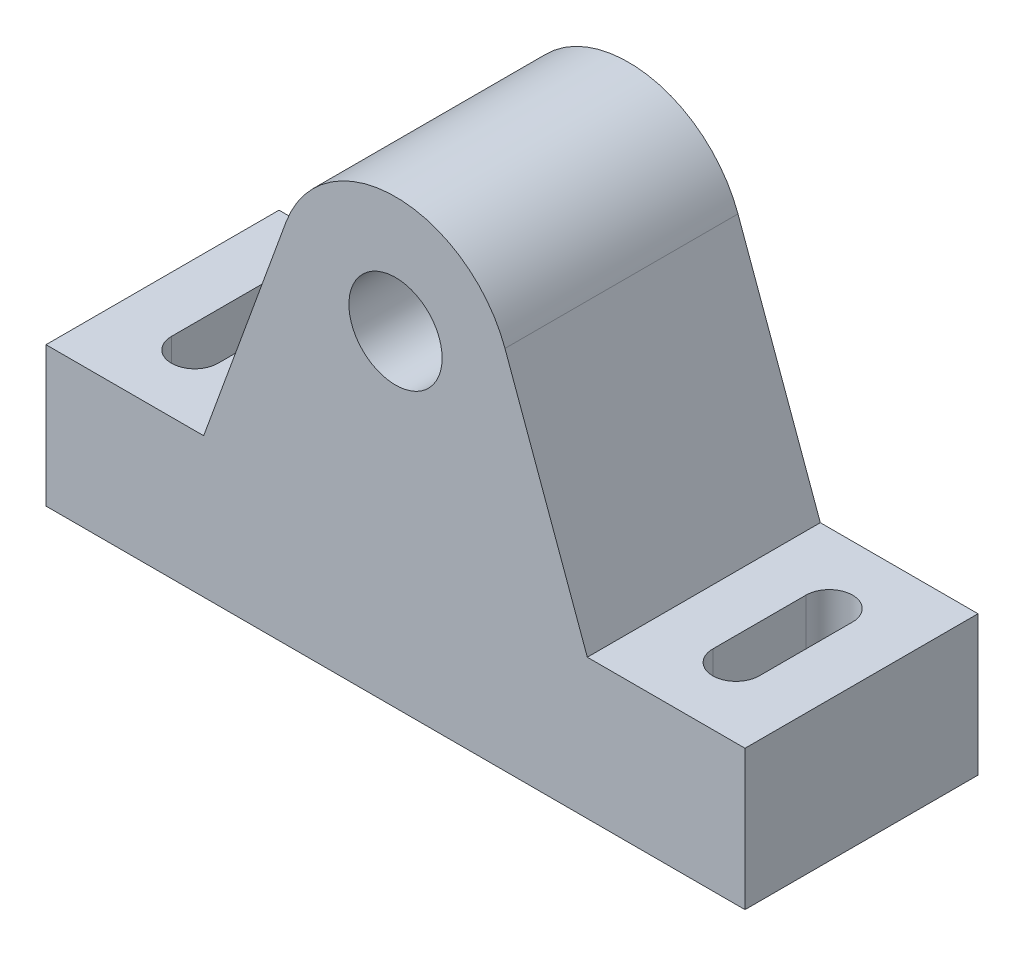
ISO-10303-21;
HEADER;
FILE_DESCRIPTION(('STEP AP214'),'2;1');
FILE_NAME('part.step','',(''),(''),'','','');
FILE_SCHEMA(('AUTOMOTIVE_DESIGN { 1 0 10303 214 1 1 1 1 }'));
ENDSEC;
DATA;
#1=APPLICATION_CONTEXT('core data for automotive mechanical design processes');
#2=APPLICATION_PROTOCOL_DEFINITION('international standard','automotive_design',2000,#1);
#3=PRODUCT_CONTEXT('',#1,'mechanical');
#4=PRODUCT('Part','Part','',(#3));
#5=PRODUCT_RELATED_PRODUCT_CATEGORY('part','',(#4));
#6=PRODUCT_DEFINITION_FORMATION('','',#4);
#7=PRODUCT_DEFINITION_CONTEXT('part definition',#1,'design');
#8=PRODUCT_DEFINITION('design','',#6,#7);
#9=PRODUCT_DEFINITION_SHAPE('','',#8);
#10=(LENGTH_UNIT() NAMED_UNIT(*) SI_UNIT(.MILLI.,.METRE.));
#11=(NAMED_UNIT(*) PLANE_ANGLE_UNIT() SI_UNIT($,.RADIAN.));
#12=(NAMED_UNIT(*) SI_UNIT($,.STERADIAN.) SOLID_ANGLE_UNIT());
#13=UNCERTAINTY_MEASURE_WITH_UNIT(LENGTH_MEASURE(1.E-05),#10,'distance_accuracy_value','');
#14=(GEOMETRIC_REPRESENTATION_CONTEXT(3) GLOBAL_UNCERTAINTY_ASSIGNED_CONTEXT((#13)) GLOBAL_UNIT_ASSIGNED_CONTEXT((#10,
#11,#12)) REPRESENTATION_CONTEXT('',''));
#15=CARTESIAN_POINT('',(0.,0.,0.));
#16=DIRECTION('',(0.,0.,1.));
#17=DIRECTION('',(1.,0.,0.));
#18=AXIS2_PLACEMENT_3D('',#15,#16,#17);
#19=CARTESIAN_POINT('',(0.,70.,25.));
#20=DIRECTION('',(0.,0.,-1.));
#21=DIRECTION('',(-1.,0.,0.));
#22=AXIS2_PLACEMENT_3D('',#19,#20,#21);
#23=PLANE('',#22);
#24=DIRECTION('',(1.,0.,0.));
#25=VECTOR('',#24,1.);
#26=CARTESIAN_POINT('',(-75.,30.,25.));
#27=LINE('',#26,#25);
#28=CARTESIAN_POINT('',(-75.,30.,25.));
#29=VERTEX_POINT('',#28);
#30=CARTESIAN_POINT('',(-41.1632536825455,30.,25.));
#31=VERTEX_POINT('',#30);
#32=EDGE_CURVE('E258',#29,#31,#27,.T.);
#33=ORIENTED_EDGE('',*,*,#32,.F.);
#34=DIRECTION('',(0.,1.,0.));
#35=VECTOR('',#34,1.);
#36=CARTESIAN_POINT('',(-75.,0.,25.));
#37=LINE('',#36,#35);
#38=CARTESIAN_POINT('',(-75.,0.,25.));
#39=VERTEX_POINT('',#38);
#40=EDGE_CURVE('E277',#39,#29,#37,.T.);
#41=ORIENTED_EDGE('',*,*,#40,.F.);
#42=DIRECTION('',(-1.,0.,0.));
#43=VECTOR('',#42,1.);
#44=CARTESIAN_POINT('',(75.,0.,25.));
#45=LINE('',#44,#43);
#46=CARTESIAN_POINT('',(75.,0.,25.));
#47=VERTEX_POINT('',#46);
#48=EDGE_CURVE('E274',#47,#39,#45,.T.);
#49=ORIENTED_EDGE('',*,*,#48,.F.);
#50=DIRECTION('',(0.,1.,0.));
#51=VECTOR('',#50,1.);
#52=CARTESIAN_POINT('',(75.,0.,25.));
#53=LINE('',#52,#51);
#54=CARTESIAN_POINT('',(75.,30.,25.));
#55=VERTEX_POINT('',#54);
#56=EDGE_CURVE('E272',#47,#55,#53,.T.);
#57=ORIENTED_EDGE('',*,*,#56,.T.);
#58=DIRECTION('',(-1.,0.,0.));
#59=VECTOR('',#58,1.);
#60=CARTESIAN_POINT('',(75.,30.,25.));
#61=LINE('',#60,#59);
#62=CARTESIAN_POINT('',(41.1632536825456,30.,25.));
#63=VERTEX_POINT('',#62);
#64=EDGE_CURVE('E270',#55,#63,#61,.T.);
#65=ORIENTED_EDGE('',*,*,#64,.T.);
#66=DIRECTION('',(-0.342020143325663,0.939692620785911,0.));
#67=VECTOR('',#66,1.);
#68=CARTESIAN_POINT('',(41.1632536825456,30.,25.));
#69=LINE('',#68,#67);
#70=CARTESIAN_POINT('',(23.4923155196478,78.5505035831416,25.));
#71=VERTEX_POINT('',#70);
#72=EDGE_CURVE('E268',#63,#71,#69,.T.);
#73=ORIENTED_EDGE('',*,*,#72,.T.);
#74=CARTESIAN_POINT('',(0.,70.,25.));
#75=DIRECTION('',(0.,0.,-1.));
#76=DIRECTION('',(-1.,0.,0.));
#77=AXIS2_PLACEMENT_3D('',#74,#75,#76);
#78=CIRCLE('',#77,25.);
#79=CARTESIAN_POINT('',(-23.4923155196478,78.5505035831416,25.));
#80=VERTEX_POINT('',#79);
#81=EDGE_CURVE('E265',#80,#71,#78,.T.);
#82=ORIENTED_EDGE('',*,*,#81,.F.);
#83=DIRECTION('',(0.342020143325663,0.939692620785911,0.));
#84=VECTOR('',#83,1.);
#85=CARTESIAN_POINT('',(-41.1632536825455,30.,25.));
#86=LINE('',#85,#84);
#87=EDGE_CURVE('E261',#31,#80,#86,.T.);
#88=ORIENTED_EDGE('',*,*,#87,.F.);
#89=EDGE_LOOP('',(#33,#41,#49,#57,#65,#73,#82,#88));
#90=FACE_BOUND('',#89,.T.);
#91=CARTESIAN_POINT('',(0.,70.,25.));
#92=DIRECTION('',(0.,0.,1.));
#93=DIRECTION('',(1.,0.,0.));
#94=AXIS2_PLACEMENT_3D('',#91,#92,#93);
#95=CIRCLE('',#94,10.);
#96=CARTESIAN_POINT('',(10.,70.,25.));
#97=VERTEX_POINT('',#96);
#98=EDGE_CURVE('E251',#97,#97,#95,.T.);
#99=ORIENTED_EDGE('',*,*,#98,.F.);
#100=EDGE_LOOP('',(#99));
#101=FACE_BOUND('',#100,.T.);
#102=ADVANCED_FACE('F68',(#90,#101),#23,.F.);
#103=CARTESIAN_POINT('',(0.,70.,-25.));
#104=DIRECTION('',(0.,0.,-1.));
#105=DIRECTION('',(-1.,0.,0.));
#106=AXIS2_PLACEMENT_3D('',#103,#104,#105);
#107=PLANE('',#106);
#108=DIRECTION('',(1.,0.,0.));
#109=VECTOR('',#108,1.);
#110=CARTESIAN_POINT('',(-75.,30.,-25.));
#111=LINE('',#110,#109);
#112=CARTESIAN_POINT('',(-75.,30.,-25.));
#113=VERTEX_POINT('',#112);
#114=CARTESIAN_POINT('',(-41.1632536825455,30.,-25.));
#115=VERTEX_POINT('',#114);
#116=EDGE_CURVE('E255',#113,#115,#111,.T.);
#117=ORIENTED_EDGE('',*,*,#116,.T.);
#118=DIRECTION('',(0.342020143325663,0.939692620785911,0.));
#119=VECTOR('',#118,1.);
#120=CARTESIAN_POINT('',(-41.1632536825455,30.,-25.));
#121=LINE('',#120,#119);
#122=CARTESIAN_POINT('',(-23.4923155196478,78.5505035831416,-25.));
#123=VERTEX_POINT('',#122);
#124=EDGE_CURVE('E282',#115,#123,#121,.T.);
#125=ORIENTED_EDGE('',*,*,#124,.T.);
#126=CARTESIAN_POINT('',(0.,70.,-25.));
#127=DIRECTION('',(0.,0.,-1.));
#128=DIRECTION('',(-1.,0.,0.));
#129=AXIS2_PLACEMENT_3D('',#126,#127,#128);
#130=CIRCLE('',#129,25.);
#131=CARTESIAN_POINT('',(23.4923155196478,78.5505035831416,-25.));
#132=VERTEX_POINT('',#131);
#133=EDGE_CURVE('E285',#123,#132,#130,.T.);
#134=ORIENTED_EDGE('',*,*,#133,.T.);
#135=DIRECTION('',(-0.342020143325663,0.939692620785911,0.));
#136=VECTOR('',#135,1.);
#137=CARTESIAN_POINT('',(41.1632536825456,30.,-25.));
#138=LINE('',#137,#136);
#139=CARTESIAN_POINT('',(41.1632536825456,30.,-25.));
#140=VERTEX_POINT('',#139);
#141=EDGE_CURVE('E288',#140,#132,#138,.T.);
#142=ORIENTED_EDGE('',*,*,#141,.F.);
#143=DIRECTION('',(-1.,0.,0.));
#144=VECTOR('',#143,1.);
#145=CARTESIAN_POINT('',(75.,30.,-25.));
#146=LINE('',#145,#144);
#147=CARTESIAN_POINT('',(75.,30.,-25.));
#148=VERTEX_POINT('',#147);
#149=EDGE_CURVE('E291',#148,#140,#146,.T.);
#150=ORIENTED_EDGE('',*,*,#149,.F.);
#151=DIRECTION('',(0.,1.,0.));
#152=VECTOR('',#151,1.);
#153=CARTESIAN_POINT('',(75.,0.,-25.));
#154=LINE('',#153,#152);
#155=CARTESIAN_POINT('',(75.,0.,-25.));
#156=VERTEX_POINT('',#155);
#157=EDGE_CURVE('E293',#156,#148,#154,.T.);
#158=ORIENTED_EDGE('',*,*,#157,.F.);
#159=DIRECTION('',(-1.,0.,0.));
#160=VECTOR('',#159,1.);
#161=CARTESIAN_POINT('',(75.,0.,-25.));
#162=LINE('',#161,#160);
#163=CARTESIAN_POINT('',(-75.,0.,-25.));
#164=VERTEX_POINT('',#163);
#165=EDGE_CURVE('E295',#156,#164,#162,.T.);
#166=ORIENTED_EDGE('',*,*,#165,.T.);
#167=DIRECTION('',(0.,1.,0.));
#168=VECTOR('',#167,1.);
#169=CARTESIAN_POINT('',(-75.,0.,-25.));
#170=LINE('',#169,#168);
#171=EDGE_CURVE('E262',#164,#113,#170,.T.);
#172=ORIENTED_EDGE('',*,*,#171,.T.);
#173=EDGE_LOOP('',(#117,#125,#134,#142,#150,#158,#166,#172));
#174=FACE_BOUND('',#173,.T.);
#175=CARTESIAN_POINT('',(0.,70.,-25.));
#176=DIRECTION('',(0.,0.,1.));
#177=DIRECTION('',(1.,0.,0.));
#178=AXIS2_PLACEMENT_3D('',#175,#176,#177);
#179=CIRCLE('',#178,10.);
#180=CARTESIAN_POINT('',(10.,70.,-25.));
#181=VERTEX_POINT('',#180);
#182=EDGE_CURVE('E216',#181,#181,#179,.T.);
#183=ORIENTED_EDGE('',*,*,#182,.T.);
#184=EDGE_LOOP('',(#183));
#185=FACE_BOUND('',#184,.T.);
#186=ADVANCED_FACE('F320',(#174,#185),#107,.T.);
#187=CARTESIAN_POINT('',(-75.,30.,25.));
#188=DIRECTION('',(0.,1.,0.));
#189=DIRECTION('',(-1.,0.,0.));
#190=AXIS2_PLACEMENT_3D('',#187,#188,#189);
#191=PLANE('',#190);
#192=CARTESIAN_POINT('',(-58.0816268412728,30.,10.));
#193=DIRECTION('',(0.,1.,0.));
#194=DIRECTION('',(-1.,0.,0.));
#195=AXIS2_PLACEMENT_3D('',#192,#193,#194);
#196=CIRCLE('',#195,5.);
#197=CARTESIAN_POINT('',(-63.0816268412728,30.,10.));
#198=VERTEX_POINT('',#197);
#199=CARTESIAN_POINT('',(-53.0816268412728,30.,10.));
#200=VERTEX_POINT('',#199);
#201=EDGE_CURVE('E85',#198,#200,#196,.T.);
#202=ORIENTED_EDGE('',*,*,#201,.F.);
#203=DIRECTION('',(0.,0.,1.));
#204=VECTOR('',#203,1.);
#205=CARTESIAN_POINT('',(-63.0816268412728,30.,10.));
#206=LINE('',#205,#204);
#207=CARTESIAN_POINT('',(-63.0816268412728,30.,-10.));
#208=VERTEX_POINT('',#207);
#209=EDGE_CURVE('E200',#208,#198,#206,.T.);
#210=ORIENTED_EDGE('',*,*,#209,.F.);
#211=CARTESIAN_POINT('',(-58.0816268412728,30.,-10.));
#212=DIRECTION('',(0.,1.,0.));
#213=DIRECTION('',(-1.,0.,0.));
#214=AXIS2_PLACEMENT_3D('',#211,#212,#213);
#215=CIRCLE('',#214,5.);
#216=CARTESIAN_POINT('',(-53.0816268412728,30.,-10.));
#217=VERTEX_POINT('',#216);
#218=EDGE_CURVE('E203',#217,#208,#215,.T.);
#219=ORIENTED_EDGE('',*,*,#218,.F.);
#220=DIRECTION('',(0.,0.,-1.));
#221=VECTOR('',#220,1.);
#222=CARTESIAN_POINT('',(-53.0816268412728,30.,10.));
#223=LINE('',#222,#221);
#224=EDGE_CURVE('E209',#200,#217,#223,.T.);
#225=ORIENTED_EDGE('',*,*,#224,.F.);
#226=EDGE_LOOP('',(#202,#210,#219,#225));
#227=FACE_BOUND('',#226,.T.);
#228=ORIENTED_EDGE('',*,*,#116,.F.);
#229=DIRECTION('',(0.,0.,-1.));
#230=VECTOR('',#229,1.);
#231=CARTESIAN_POINT('',(-75.,30.,25.));
#232=LINE('',#231,#230);
#233=EDGE_CURVE('E12',#29,#113,#232,.T.);
#234=ORIENTED_EDGE('',*,*,#233,.F.);
#235=ORIENTED_EDGE('',*,*,#32,.T.);
#236=DIRECTION('',(0.,0.,-1.));
#237=VECTOR('',#236,1.);
#238=CARTESIAN_POINT('',(-41.1632536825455,30.,25.));
#239=LINE('',#238,#237);
#240=EDGE_CURVE('E72',#31,#115,#239,.T.);
#241=ORIENTED_EDGE('',*,*,#240,.T.);
#242=EDGE_LOOP('',(#228,#234,#235,#241));
#243=FACE_BOUND('',#242,.T.);
#244=ADVANCED_FACE('F70',(#227,#243),#191,.T.);
#245=CARTESIAN_POINT('',(-75.,0.,25.));
#246=DIRECTION('',(-1.,0.,0.));
#247=DIRECTION('',(0.,-1.,0.));
#248=AXIS2_PLACEMENT_3D('',#245,#246,#247);
#249=PLANE('',#248);
#250=ORIENTED_EDGE('',*,*,#171,.F.);
#251=DIRECTION('',(0.,0.,-1.));
#252=VECTOR('',#251,1.);
#253=CARTESIAN_POINT('',(-75.,0.,25.));
#254=LINE('',#253,#252);
#255=EDGE_CURVE('E77',#39,#164,#254,.T.);
#256=ORIENTED_EDGE('',*,*,#255,.F.);
#257=ORIENTED_EDGE('',*,*,#40,.T.);
#258=ORIENTED_EDGE('',*,*,#233,.T.);
#259=EDGE_LOOP('',(#250,#256,#257,#258));
#260=FACE_BOUND('',#259,.T.);
#261=ADVANCED_FACE('F326',(#260),#249,.T.);
#262=CARTESIAN_POINT('',(75.,0.,25.));
#263=DIRECTION('',(0.,-1.,0.));
#264=DIRECTION('',(0.,0.,-1.));
#265=AXIS2_PLACEMENT_3D('',#262,#263,#264);
#266=PLANE('',#265);
#267=CARTESIAN_POINT('',(-58.0816268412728,0.,10.));
#268=DIRECTION('',(0.,1.,0.));
#269=DIRECTION('',(-1.,0.,0.));
#270=AXIS2_PLACEMENT_3D('',#267,#268,#269);
#271=CIRCLE('',#270,5.);
#272=CARTESIAN_POINT('',(-63.0816268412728,0.,10.));
#273=VERTEX_POINT('',#272);
#274=CARTESIAN_POINT('',(-53.0816268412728,0.,10.));
#275=VERTEX_POINT('',#274);
#276=EDGE_CURVE('E184',#273,#275,#271,.T.);
#277=ORIENTED_EDGE('',*,*,#276,.T.);
#278=DIRECTION('',(0.,0.,-1.));
#279=VECTOR('',#278,1.);
#280=CARTESIAN_POINT('',(-53.0816268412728,0.,10.));
#281=LINE('',#280,#279);
#282=CARTESIAN_POINT('',(-53.0816268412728,0.,-10.));
#283=VERTEX_POINT('',#282);
#284=EDGE_CURVE('E193',#275,#283,#281,.T.);
#285=ORIENTED_EDGE('',*,*,#284,.T.);
#286=CARTESIAN_POINT('',(-58.0816268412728,0.,-10.));
#287=DIRECTION('',(0.,1.,0.));
#288=DIRECTION('',(-1.,0.,0.));
#289=AXIS2_PLACEMENT_3D('',#286,#287,#288);
#290=CIRCLE('',#289,5.);
#291=CARTESIAN_POINT('',(-63.0816268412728,0.,-10.));
#292=VERTEX_POINT('',#291);
#293=EDGE_CURVE('E93',#283,#292,#290,.T.);
#294=ORIENTED_EDGE('',*,*,#293,.T.);
#295=DIRECTION('',(0.,0.,1.));
#296=VECTOR('',#295,1.);
#297=CARTESIAN_POINT('',(-63.0816268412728,0.,10.));
#298=LINE('',#297,#296);
#299=EDGE_CURVE('E190',#292,#273,#298,.T.);
#300=ORIENTED_EDGE('',*,*,#299,.T.);
#301=EDGE_LOOP('',(#277,#285,#294,#300));
#302=FACE_BOUND('',#301,.T.);
#303=CARTESIAN_POINT('',(58.0816268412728,0.,10.));
#304=DIRECTION('',(0.,1.,0.));
#305=DIRECTION('',(1.,0.,0.));
#306=AXIS2_PLACEMENT_3D('',#303,#304,#305);
#307=CIRCLE('',#306,5.00000000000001);
#308=CARTESIAN_POINT('',(53.0816268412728,0.,10.));
#309=VERTEX_POINT('',#308);
#310=CARTESIAN_POINT('',(63.0816268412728,0.,10.));
#311=VERTEX_POINT('',#310);
#312=EDGE_CURVE('E234',#309,#311,#307,.T.);
#313=ORIENTED_EDGE('',*,*,#312,.T.);
#314=DIRECTION('',(0.,0.,-1.));
#315=VECTOR('',#314,1.);
#316=CARTESIAN_POINT('',(63.0816268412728,0.,10.));
#317=LINE('',#316,#315);
#318=CARTESIAN_POINT('',(63.0816268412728,0.,-10.));
#319=VERTEX_POINT('',#318);
#320=EDGE_CURVE('E246',#311,#319,#317,.T.);
#321=ORIENTED_EDGE('',*,*,#320,.T.);
#322=CARTESIAN_POINT('',(58.0816268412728,0.,-10.));
#323=DIRECTION('',(0.,1.,0.));
#324=DIRECTION('',(1.,0.,0.));
#325=AXIS2_PLACEMENT_3D('',#322,#323,#324);
#326=CIRCLE('',#325,5.00000000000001);
#327=CARTESIAN_POINT('',(53.0816268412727,0.,-10.));
#328=VERTEX_POINT('',#327);
#329=EDGE_CURVE('E243',#319,#328,#326,.T.);
#330=ORIENTED_EDGE('',*,*,#329,.T.);
#331=DIRECTION('',(0.,0.,1.));
#332=VECTOR('',#331,1.);
#333=CARTESIAN_POINT('',(53.0816268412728,0.,10.));
#334=LINE('',#333,#332);
#335=EDGE_CURVE('E223',#328,#309,#334,.T.);
#336=ORIENTED_EDGE('',*,*,#335,.T.);
#337=EDGE_LOOP('',(#313,#321,#330,#336));
#338=FACE_BOUND('',#337,.T.);
#339=ORIENTED_EDGE('',*,*,#165,.F.);
#340=DIRECTION('',(0.,0.,-1.));
#341=VECTOR('',#340,1.);
#342=CARTESIAN_POINT('',(75.,0.,25.));
#343=LINE('',#342,#341);
#344=EDGE_CURVE('E301',#47,#156,#343,.T.);
#345=ORIENTED_EDGE('',*,*,#344,.F.);
#346=ORIENTED_EDGE('',*,*,#48,.T.);
#347=ORIENTED_EDGE('',*,*,#255,.T.);
#348=EDGE_LOOP('',(#339,#345,#346,#347));
#349=FACE_BOUND('',#348,.T.);
#350=ADVANCED_FACE('F197',(#302,#338,#349),#266,.T.);
#351=CARTESIAN_POINT('',(75.,0.,25.));
#352=DIRECTION('',(-1.,0.,0.));
#353=DIRECTION('',(0.,-1.,0.));
#354=AXIS2_PLACEMENT_3D('',#351,#352,#353);
#355=PLANE('',#354);
#356=ORIENTED_EDGE('',*,*,#157,.T.);
#357=DIRECTION('',(0.,0.,-1.));
#358=VECTOR('',#357,1.);
#359=CARTESIAN_POINT('',(75.,30.,25.));
#360=LINE('',#359,#358);
#361=EDGE_CURVE('E303',#55,#148,#360,.T.);
#362=ORIENTED_EDGE('',*,*,#361,.F.);
#363=ORIENTED_EDGE('',*,*,#56,.F.);
#364=ORIENTED_EDGE('',*,*,#344,.T.);
#365=EDGE_LOOP('',(#356,#362,#363,#364));
#366=FACE_BOUND('',#365,.T.);
#367=ADVANCED_FACE('F347',(#366),#355,.F.);
#368=CARTESIAN_POINT('',(75.,30.,25.));
#369=DIRECTION('',(0.,-1.,0.));
#370=DIRECTION('',(1.,0.,0.));
#371=AXIS2_PLACEMENT_3D('',#368,#369,#370);
#372=PLANE('',#371);
#373=DIRECTION('',(0.,0.,-1.));
#374=VECTOR('',#373,1.);
#375=CARTESIAN_POINT('',(63.0816268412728,30.,10.));
#376=LINE('',#375,#374);
#377=CARTESIAN_POINT('',(63.0816268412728,30.,10.));
#378=VERTEX_POINT('',#377);
#379=CARTESIAN_POINT('',(63.0816268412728,30.,-10.));
#380=VERTEX_POINT('',#379);
#381=EDGE_CURVE('E237',#378,#380,#376,.T.);
#382=ORIENTED_EDGE('',*,*,#381,.F.);
#383=CARTESIAN_POINT('',(58.0816268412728,30.,10.));
#384=DIRECTION('',(0.,1.,0.));
#385=DIRECTION('',(1.,0.,0.));
#386=AXIS2_PLACEMENT_3D('',#383,#384,#385);
#387=CIRCLE('',#386,5.00000000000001);
#388=CARTESIAN_POINT('',(53.0816268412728,30.,10.));
#389=VERTEX_POINT('',#388);
#390=EDGE_CURVE('E210',#389,#378,#387,.T.);
#391=ORIENTED_EDGE('',*,*,#390,.F.);
#392=DIRECTION('',(0.,0.,1.));
#393=VECTOR('',#392,1.);
#394=CARTESIAN_POINT('',(53.0816268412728,30.,10.));
#395=LINE('',#394,#393);
#396=CARTESIAN_POINT('',(53.0816268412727,30.,-10.));
#397=VERTEX_POINT('',#396);
#398=EDGE_CURVE('E230',#397,#389,#395,.T.);
#399=ORIENTED_EDGE('',*,*,#398,.F.);
#400=CARTESIAN_POINT('',(58.0816268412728,30.,-10.));
#401=DIRECTION('',(0.,1.,0.));
#402=DIRECTION('',(1.,0.,0.));
#403=AXIS2_PLACEMENT_3D('',#400,#401,#402);
#404=CIRCLE('',#403,5.00000000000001);
#405=EDGE_CURVE('E233',#380,#397,#404,.T.);
#406=ORIENTED_EDGE('',*,*,#405,.F.);
#407=EDGE_LOOP('',(#382,#391,#399,#406));
#408=FACE_BOUND('',#407,.T.);
#409=ORIENTED_EDGE('',*,*,#149,.T.);
#410=DIRECTION('',(0.,0.,-1.));
#411=VECTOR('',#410,1.);
#412=CARTESIAN_POINT('',(41.1632536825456,30.,25.));
#413=LINE('',#412,#411);
#414=EDGE_CURVE('E306',#63,#140,#413,.T.);
#415=ORIENTED_EDGE('',*,*,#414,.F.);
#416=ORIENTED_EDGE('',*,*,#64,.F.);
#417=ORIENTED_EDGE('',*,*,#361,.T.);
#418=EDGE_LOOP('',(#409,#415,#416,#417));
#419=FACE_BOUND('',#418,.T.);
#420=ADVANCED_FACE('F343',(#408,#419),#372,.F.);
#421=CARTESIAN_POINT('',(41.1632536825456,30.,25.));
#422=DIRECTION('',(-0.939692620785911,-0.342020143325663,0.));
#423=DIRECTION('',(0.342020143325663,-0.939692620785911,0.));
#424=AXIS2_PLACEMENT_3D('',#421,#422,#423);
#425=PLANE('',#424);
#426=ORIENTED_EDGE('',*,*,#141,.T.);
#427=DIRECTION('',(0.,0.,-1.));
#428=VECTOR('',#427,1.);
#429=CARTESIAN_POINT('',(23.4923155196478,78.5505035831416,25.));
#430=LINE('',#429,#428);
#431=EDGE_CURVE('E309',#71,#132,#430,.T.);
#432=ORIENTED_EDGE('',*,*,#431,.F.);
#433=ORIENTED_EDGE('',*,*,#72,.F.);
#434=ORIENTED_EDGE('',*,*,#414,.T.);
#435=EDGE_LOOP('',(#426,#432,#433,#434));
#436=FACE_BOUND('',#435,.T.);
#437=ADVANCED_FACE('F339',(#436),#425,.F.);
#438=CARTESIAN_POINT('',(0.,70.,25.));
#439=DIRECTION('',(0.,0.,-1.));
#440=DIRECTION('',(-1.,0.,0.));
#441=AXIS2_PLACEMENT_3D('',#438,#439,#440);
#442=CYLINDRICAL_SURFACE('',#441,25.);
#443=ORIENTED_EDGE('',*,*,#133,.F.);
#444=DIRECTION('',(0.,0.,-1.));
#445=VECTOR('',#444,1.);
#446=CARTESIAN_POINT('',(-23.4923155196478,78.5505035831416,25.));
#447=LINE('',#446,#445);
#448=EDGE_CURVE('E310',#80,#123,#447,.T.);
#449=ORIENTED_EDGE('',*,*,#448,.F.);
#450=ORIENTED_EDGE('',*,*,#81,.T.);
#451=ORIENTED_EDGE('',*,*,#431,.T.);
#452=EDGE_LOOP('',(#443,#449,#450,#451));
#453=FACE_BOUND('',#452,.T.);
#454=ADVANCED_FACE('F335',(#453),#442,.T.);
#455=CARTESIAN_POINT('',(-41.1632536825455,30.,25.));
#456=DIRECTION('',(-0.939692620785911,0.342020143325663,0.));
#457=DIRECTION('',(-0.342020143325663,-0.939692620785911,0.));
#458=AXIS2_PLACEMENT_3D('',#455,#456,#457);
#459=PLANE('',#458);
#460=ORIENTED_EDGE('',*,*,#124,.F.);
#461=ORIENTED_EDGE('',*,*,#240,.F.);
#462=ORIENTED_EDGE('',*,*,#87,.T.);
#463=ORIENTED_EDGE('',*,*,#448,.T.);
#464=EDGE_LOOP('',(#460,#461,#462,#463));
#465=FACE_BOUND('',#464,.T.);
#466=ADVANCED_FACE('F318',(#465),#459,.T.);
#467=CARTESIAN_POINT('',(0.,70.,25.));
#468=DIRECTION('',(0.,0.,-1.));
#469=DIRECTION('',(-1.,0.,0.));
#470=AXIS2_PLACEMENT_3D('',#467,#468,#469);
#471=CYLINDRICAL_SURFACE('',#470,10.);
#472=ORIENTED_EDGE('',*,*,#98,.T.);
#473=EDGE_LOOP('',(#472));
#474=FACE_BOUND('',#473,.T.);
#475=ORIENTED_EDGE('',*,*,#182,.F.);
#476=EDGE_LOOP('',(#475));
#477=FACE_BOUND('',#476,.T.);
#478=ADVANCED_FACE('F364',(#474,#477),#471,.F.);
#479=CARTESIAN_POINT('',(58.0816268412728,0.,10.));
#480=DIRECTION('',(0.,1.,0.));
#481=DIRECTION('',(-1.,0.,0.));
#482=AXIS2_PLACEMENT_3D('',#479,#480,#481);
#483=CYLINDRICAL_SURFACE('',#482,5.00000000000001);
#484=ORIENTED_EDGE('',*,*,#390,.T.);
#485=DIRECTION('',(0.,1.,0.));
#486=VECTOR('',#485,1.);
#487=CARTESIAN_POINT('',(63.0816268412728,0.,10.));
#488=LINE('',#487,#486);
#489=EDGE_CURVE('E220',#311,#378,#488,.T.);
#490=ORIENTED_EDGE('',*,*,#489,.F.);
#491=ORIENTED_EDGE('',*,*,#312,.F.);
#492=DIRECTION('',(0.,1.,0.));
#493=VECTOR('',#492,1.);
#494=CARTESIAN_POINT('',(53.0816268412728,0.,10.));
#495=LINE('',#494,#493);
#496=EDGE_CURVE('E228',#309,#389,#495,.T.);
#497=ORIENTED_EDGE('',*,*,#496,.T.);
#498=EDGE_LOOP('',(#484,#490,#491,#497));
#499=FACE_BOUND('',#498,.T.);
#500=ADVANCED_FACE('F367',(#499),#483,.F.);
#501=CARTESIAN_POINT('',(53.0816268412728,0.,10.));
#502=DIRECTION('',(-1.,0.,0.));
#503=DIRECTION('',(0.,-1.,0.));
#504=AXIS2_PLACEMENT_3D('',#501,#502,#503);
#505=PLANE('',#504);
#506=ORIENTED_EDGE('',*,*,#398,.T.);
#507=ORIENTED_EDGE('',*,*,#496,.F.);
#508=ORIENTED_EDGE('',*,*,#335,.F.);
#509=DIRECTION('',(0.,1.,0.));
#510=VECTOR('',#509,1.);
#511=CARTESIAN_POINT('',(53.0816268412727,0.,-10.));
#512=LINE('',#511,#510);
#513=EDGE_CURVE('E226',#328,#397,#512,.T.);
#514=ORIENTED_EDGE('',*,*,#513,.T.);
#515=EDGE_LOOP('',(#506,#507,#508,#514));
#516=FACE_BOUND('',#515,.T.);
#517=ADVANCED_FACE('F369',(#516),#505,.F.);
#518=CARTESIAN_POINT('',(58.0816268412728,0.,-10.));
#519=DIRECTION('',(0.,1.,0.));
#520=DIRECTION('',(-1.,0.,0.));
#521=AXIS2_PLACEMENT_3D('',#518,#519,#520);
#522=CYLINDRICAL_SURFACE('',#521,5.00000000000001);
#523=ORIENTED_EDGE('',*,*,#405,.T.);
#524=ORIENTED_EDGE('',*,*,#513,.F.);
#525=ORIENTED_EDGE('',*,*,#329,.F.);
#526=DIRECTION('',(0.,1.,0.));
#527=VECTOR('',#526,1.);
#528=CARTESIAN_POINT('',(63.0816268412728,0.,-10.));
#529=LINE('',#528,#527);
#530=EDGE_CURVE('E224',#319,#380,#529,.T.);
#531=ORIENTED_EDGE('',*,*,#530,.T.);
#532=EDGE_LOOP('',(#523,#524,#525,#531));
#533=FACE_BOUND('',#532,.T.);
#534=ADVANCED_FACE('F372',(#533),#522,.F.);
#535=CARTESIAN_POINT('',(63.0816268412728,0.,10.));
#536=DIRECTION('',(1.,0.,0.));
#537=DIRECTION('',(0.,1.,0.));
#538=AXIS2_PLACEMENT_3D('',#535,#536,#537);
#539=PLANE('',#538);
#540=ORIENTED_EDGE('',*,*,#381,.T.);
#541=ORIENTED_EDGE('',*,*,#530,.F.);
#542=ORIENTED_EDGE('',*,*,#320,.F.);
#543=ORIENTED_EDGE('',*,*,#489,.T.);
#544=EDGE_LOOP('',(#540,#541,#542,#543));
#545=FACE_BOUND('',#544,.T.);
#546=ADVANCED_FACE('F376',(#545),#539,.F.);
#547=CARTESIAN_POINT('',(-58.0816268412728,0.,10.));
#548=DIRECTION('',(0.,1.,0.));
#549=DIRECTION('',(-1.,0.,0.));
#550=AXIS2_PLACEMENT_3D('',#547,#548,#549);
#551=CYLINDRICAL_SURFACE('',#550,5.);
#552=ORIENTED_EDGE('',*,*,#201,.T.);
#553=DIRECTION('',(0.,1.,0.));
#554=VECTOR('',#553,1.);
#555=CARTESIAN_POINT('',(-53.0816268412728,0.,10.));
#556=LINE('',#555,#554);
#557=EDGE_CURVE('E180',#275,#200,#556,.T.);
#558=ORIENTED_EDGE('',*,*,#557,.F.);
#559=ORIENTED_EDGE('',*,*,#276,.F.);
#560=DIRECTION('',(0.,1.,0.));
#561=VECTOR('',#560,1.);
#562=CARTESIAN_POINT('',(-63.0816268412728,0.,10.));
#563=LINE('',#562,#561);
#564=EDGE_CURVE('E214',#273,#198,#563,.T.);
#565=ORIENTED_EDGE('',*,*,#564,.T.);
#566=EDGE_LOOP('',(#552,#558,#559,#565));
#567=FACE_BOUND('',#566,.T.);
#568=ADVANCED_FACE('F182',(#567),#551,.F.);
#569=CARTESIAN_POINT('',(-63.0816268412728,0.,10.));
#570=DIRECTION('',(-1.,0.,0.));
#571=DIRECTION('',(0.,-1.,0.));
#572=AXIS2_PLACEMENT_3D('',#569,#570,#571);
#573=PLANE('',#572);
#574=ORIENTED_EDGE('',*,*,#209,.T.);
#575=ORIENTED_EDGE('',*,*,#564,.F.);
#576=ORIENTED_EDGE('',*,*,#299,.F.);
#577=DIRECTION('',(0.,1.,0.));
#578=VECTOR('',#577,1.);
#579=CARTESIAN_POINT('',(-63.0816268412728,0.,-10.));
#580=LINE('',#579,#578);
#581=EDGE_CURVE('E217',#292,#208,#580,.T.);
#582=ORIENTED_EDGE('',*,*,#581,.T.);
#583=EDGE_LOOP('',(#574,#575,#576,#582));
#584=FACE_BOUND('',#583,.T.);
#585=ADVANCED_FACE('F386',(#584),#573,.F.);
#586=CARTESIAN_POINT('',(-58.0816268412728,0.,-10.));
#587=DIRECTION('',(0.,1.,0.));
#588=DIRECTION('',(-1.,0.,0.));
#589=AXIS2_PLACEMENT_3D('',#586,#587,#588);
#590=CYLINDRICAL_SURFACE('',#589,5.);
#591=ORIENTED_EDGE('',*,*,#218,.T.);
#592=ORIENTED_EDGE('',*,*,#581,.F.);
#593=ORIENTED_EDGE('',*,*,#293,.F.);
#594=DIRECTION('',(0.,1.,0.));
#595=VECTOR('',#594,1.);
#596=CARTESIAN_POINT('',(-53.0816268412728,0.,-10.));
#597=LINE('',#596,#595);
#598=EDGE_CURVE('E189',#283,#217,#597,.T.);
#599=ORIENTED_EDGE('',*,*,#598,.T.);
#600=EDGE_LOOP('',(#591,#592,#593,#599));
#601=FACE_BOUND('',#600,.T.);
#602=ADVANCED_FACE('F389',(#601),#590,.F.);
#603=CARTESIAN_POINT('',(-53.0816268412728,0.,10.));
#604=DIRECTION('',(1.,0.,0.));
#605=DIRECTION('',(0.,1.,0.));
#606=AXIS2_PLACEMENT_3D('',#603,#604,#605);
#607=PLANE('',#606);
#608=ORIENTED_EDGE('',*,*,#224,.T.);
#609=ORIENTED_EDGE('',*,*,#598,.F.);
#610=ORIENTED_EDGE('',*,*,#284,.F.);
#611=ORIENTED_EDGE('',*,*,#557,.T.);
#612=EDGE_LOOP('',(#608,#609,#610,#611));
#613=FACE_BOUND('',#612,.T.);
#614=ADVANCED_FACE('F194',(#613),#607,.F.);
#615=CLOSED_SHELL('',(#102,#186,#244,#261,#350,#367,#420,#437,#454,#466,#478,#500,#517,#534,
#546,#568,#585,#602,#614));
#616=MANIFOLD_SOLID_BREP('B2',#615);
#617=ADVANCED_BREP_SHAPE_REPRESENTATION('',(#18,#616),#14);
#618=SHAPE_DEFINITION_REPRESENTATION(#9,#617);
ENDSEC;
END-ISO-10303-21;
